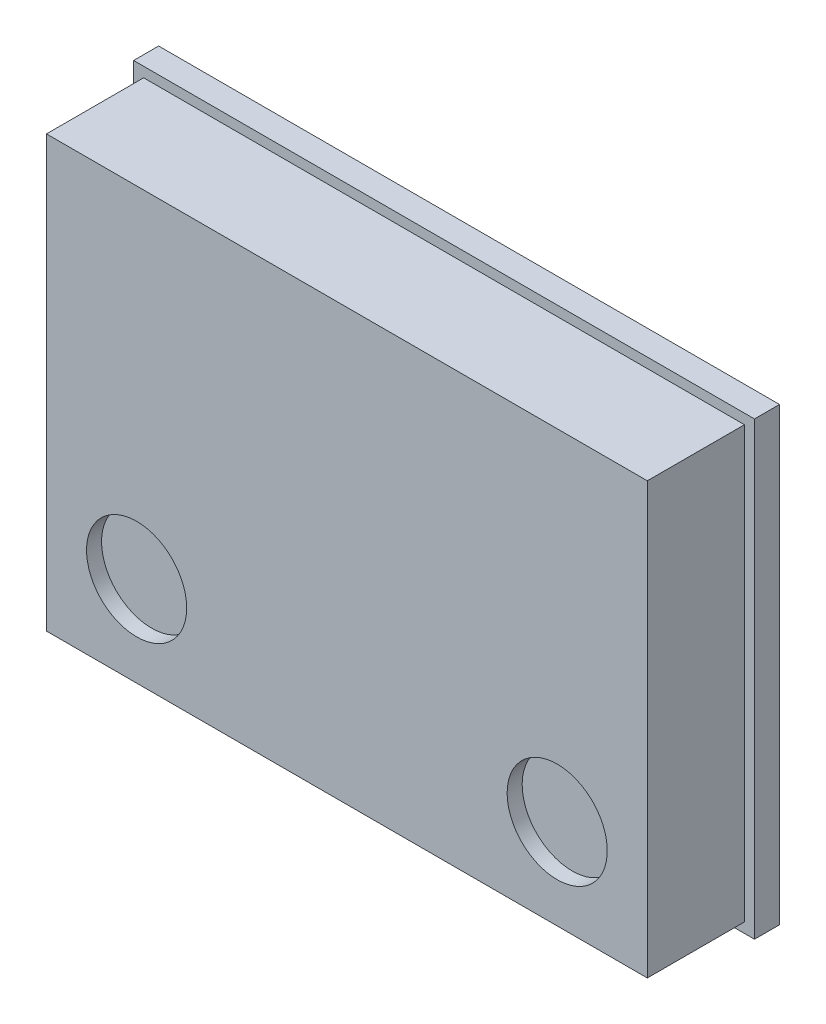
ISO-10303-21;
HEADER;
FILE_DESCRIPTION(('STEP AP214'),'2;1');
FILE_NAME('part.step','',(''),(''),'','','');
FILE_SCHEMA(('AUTOMOTIVE_DESIGN { 1 0 10303 214 1 1 1 1 }'));
ENDSEC;
DATA;
#1=APPLICATION_CONTEXT('core data for automotive mechanical design processes');
#2=APPLICATION_PROTOCOL_DEFINITION('international standard','automotive_design',2000,#1);
#3=PRODUCT_CONTEXT('',#1,'mechanical');
#4=PRODUCT('Part','Part','',(#3));
#5=PRODUCT_RELATED_PRODUCT_CATEGORY('part','',(#4));
#6=PRODUCT_DEFINITION_FORMATION('','',#4);
#7=PRODUCT_DEFINITION_CONTEXT('part definition',#1,'design');
#8=PRODUCT_DEFINITION('design','',#6,#7);
#9=PRODUCT_DEFINITION_SHAPE('','',#8);
#10=(LENGTH_UNIT() NAMED_UNIT(*) SI_UNIT(.MILLI.,.METRE.));
#11=(NAMED_UNIT(*) PLANE_ANGLE_UNIT() SI_UNIT($,.RADIAN.));
#12=(NAMED_UNIT(*) SI_UNIT($,.STERADIAN.) SOLID_ANGLE_UNIT());
#13=UNCERTAINTY_MEASURE_WITH_UNIT(LENGTH_MEASURE(1.E-05),#10,'distance_accuracy_value','');
#14=(GEOMETRIC_REPRESENTATION_CONTEXT(3) GLOBAL_UNCERTAINTY_ASSIGNED_CONTEXT((#13)) GLOBAL_UNIT_ASSIGNED_CONTEXT((#10,
#11,#12)) REPRESENTATION_CONTEXT('',''));
#15=CARTESIAN_POINT('',(0.,0.,0.));
#16=DIRECTION('',(0.,0.,1.));
#17=DIRECTION('',(1.,0.,0.));
#18=AXIS2_PLACEMENT_3D('',#15,#16,#17);
#19=CARTESIAN_POINT('',(-3.,-2.9,1.095));
#20=DIRECTION('',(1.,0.,0.));
#21=DIRECTION('',(0.,0.,-1.));
#22=AXIS2_PLACEMENT_3D('',#19,#20,#21);
#23=PLANE('',#22);
#24=DIRECTION('',(0.,-1.,0.));
#25=VECTOR('',#24,1.);
#26=CARTESIAN_POINT('',(-3.,-2.9,0.125));
#27=LINE('',#26,#25);
#28=CARTESIAN_POINT('',(-3.,1.4,0.125));
#29=VERTEX_POINT('',#28);
#30=CARTESIAN_POINT('',(-3.,-2.9,0.125));
#31=VERTEX_POINT('',#30);
#32=EDGE_CURVE('E86',#29,#31,#27,.T.);
#33=ORIENTED_EDGE('',*,*,#32,.T.);
#34=DIRECTION('',(0.,0.,-1.));
#35=VECTOR('',#34,1.);
#36=CARTESIAN_POINT('',(-3.,-2.9,1.095));
#37=LINE('',#36,#35);
#38=CARTESIAN_POINT('',(-3.,-2.9,1.095));
#39=VERTEX_POINT('',#38);
#40=EDGE_CURVE('E12',#39,#31,#37,.T.);
#41=ORIENTED_EDGE('',*,*,#40,.F.);
#42=DIRECTION('',(0.,-1.,0.));
#43=VECTOR('',#42,1.);
#44=CARTESIAN_POINT('',(-3.,-2.9,1.095));
#45=LINE('',#44,#43);
#46=CARTESIAN_POINT('',(-3.,1.4,1.095));
#47=VERTEX_POINT('',#46);
#48=EDGE_CURVE('E88',#47,#39,#45,.T.);
#49=ORIENTED_EDGE('',*,*,#48,.F.);
#50=DIRECTION('',(0.,0.,-1.));
#51=VECTOR('',#50,1.);
#52=CARTESIAN_POINT('',(-3.,1.4,1.095));
#53=LINE('',#52,#51);
#54=EDGE_CURVE('E49',#47,#29,#53,.T.);
#55=ORIENTED_EDGE('',*,*,#54,.T.);
#56=EDGE_LOOP('',(#33,#41,#49,#55));
#57=FACE_BOUND('',#56,.T.);
#58=ADVANCED_FACE('F41',(#57),#23,.F.);
#59=CARTESIAN_POINT('',(-3.,-2.9,1.095));
#60=DIRECTION('',(0.,1.,0.));
#61=DIRECTION('',(0.,0.,1.));
#62=AXIS2_PLACEMENT_3D('',#59,#60,#61);
#63=PLANE('',#62);
#64=DIRECTION('',(1.,0.,0.));
#65=VECTOR('',#64,1.);
#66=CARTESIAN_POINT('',(-3.,-2.9,0.125));
#67=LINE('',#66,#65);
#68=CARTESIAN_POINT('',(3.,-2.9,0.125));
#69=VERTEX_POINT('',#68);
#70=EDGE_CURVE('E69',#31,#69,#67,.T.);
#71=ORIENTED_EDGE('',*,*,#70,.T.);
#72=DIRECTION('',(0.,0.,-1.));
#73=VECTOR('',#72,1.);
#74=CARTESIAN_POINT('',(3.,-2.9,1.095));
#75=LINE('',#74,#73);
#76=CARTESIAN_POINT('',(3.,-2.9,1.095));
#77=VERTEX_POINT('',#76);
#78=EDGE_CURVE('E95',#77,#69,#75,.T.);
#79=ORIENTED_EDGE('',*,*,#78,.F.);
#80=DIRECTION('',(1.,0.,0.));
#81=VECTOR('',#80,1.);
#82=CARTESIAN_POINT('',(-3.,-2.9,1.095));
#83=LINE('',#82,#81);
#84=EDGE_CURVE('E117',#39,#77,#83,.T.);
#85=ORIENTED_EDGE('',*,*,#84,.F.);
#86=ORIENTED_EDGE('',*,*,#40,.T.);
#87=EDGE_LOOP('',(#71,#79,#85,#86));
#88=FACE_BOUND('',#87,.T.);
#89=ADVANCED_FACE('F127',(#88),#63,.F.);
#90=CARTESIAN_POINT('',(-3.,1.4,1.095));
#91=DIRECTION('',(0.,-1.,0.));
#92=DIRECTION('',(0.,0.,-1.));
#93=AXIS2_PLACEMENT_3D('',#90,#91,#92);
#94=PLANE('',#93);
#95=DIRECTION('',(-1.,0.,0.));
#96=VECTOR('',#95,1.);
#97=CARTESIAN_POINT('',(-3.,1.4,0.125));
#98=LINE('',#97,#96);
#99=CARTESIAN_POINT('',(3.,1.4,0.125));
#100=VERTEX_POINT('',#99);
#101=EDGE_CURVE('E81',#100,#29,#98,.T.);
#102=ORIENTED_EDGE('',*,*,#101,.T.);
#103=ORIENTED_EDGE('',*,*,#54,.F.);
#104=DIRECTION('',(-1.,0.,0.));
#105=VECTOR('',#104,1.);
#106=CARTESIAN_POINT('',(-3.,1.4,1.095));
#107=LINE('',#106,#105);
#108=CARTESIAN_POINT('',(3.,1.4,1.095));
#109=VERTEX_POINT('',#108);
#110=EDGE_CURVE('E57',#109,#47,#107,.T.);
#111=ORIENTED_EDGE('',*,*,#110,.F.);
#112=DIRECTION('',(0.,0.,-1.));
#113=VECTOR('',#112,1.);
#114=CARTESIAN_POINT('',(3.,1.4,1.095));
#115=LINE('',#114,#113);
#116=EDGE_CURVE('E91',#109,#100,#115,.T.);
#117=ORIENTED_EDGE('',*,*,#116,.T.);
#118=EDGE_LOOP('',(#102,#103,#111,#117));
#119=FACE_BOUND('',#118,.T.);
#120=ADVANCED_FACE('F92',(#119),#94,.F.);
#121=CARTESIAN_POINT('',(-3.,1.4,1.095));
#122=DIRECTION('',(0.,0.,-1.));
#123=DIRECTION('',(-1.,0.,0.));
#124=AXIS2_PLACEMENT_3D('',#121,#122,#123);
#125=PLANE('',#124);
#126=CARTESIAN_POINT('',(-2.1,-2.,1.095));
#127=DIRECTION('',(0.,0.,1.));
#128=DIRECTION('',(1.,0.,0.));
#129=AXIS2_PLACEMENT_3D('',#126,#127,#128);
#130=CIRCLE('',#129,0.5);
#131=CARTESIAN_POINT('',(-1.6,-2.,1.095));
#132=VERTEX_POINT('',#131);
#133=EDGE_CURVE('E110',#132,#132,#130,.T.);
#134=ORIENTED_EDGE('',*,*,#133,.F.);
#135=EDGE_LOOP('',(#134));
#136=FACE_BOUND('',#135,.T.);
#137=ORIENTED_EDGE('',*,*,#48,.T.);
#138=ORIENTED_EDGE('',*,*,#84,.T.);
#139=DIRECTION('',(0.,-1.,0.));
#140=VECTOR('',#139,1.);
#141=CARTESIAN_POINT('',(3.,-2.9,1.095));
#142=LINE('',#141,#140);
#143=EDGE_CURVE('E96',#109,#77,#142,.T.);
#144=ORIENTED_EDGE('',*,*,#143,.F.);
#145=ORIENTED_EDGE('',*,*,#110,.T.);
#146=EDGE_LOOP('',(#137,#138,#144,#145));
#147=FACE_BOUND('',#146,.T.);
#148=CARTESIAN_POINT('',(2.1,-2.,1.095));
#149=DIRECTION('',(0.,0.,-1.));
#150=DIRECTION('',(-1.,0.,0.));
#151=AXIS2_PLACEMENT_3D('',#148,#149,#150);
#152=CIRCLE('',#151,0.5);
#153=CARTESIAN_POINT('',(1.6,-2.,1.095));
#154=VERTEX_POINT('',#153);
#155=EDGE_CURVE('E105',#154,#154,#152,.T.);
#156=ORIENTED_EDGE('',*,*,#155,.T.);
#157=EDGE_LOOP('',(#156));
#158=FACE_BOUND('',#157,.T.);
#159=ADVANCED_FACE('F124',(#136,#147,#158),#125,.F.);
#160=CARTESIAN_POINT('',(-3.,1.4,0.125));
#161=DIRECTION('',(0.,0.,-1.));
#162=DIRECTION('',(-1.,0.,0.));
#163=AXIS2_PLACEMENT_3D('',#160,#161,#162);
#164=PLANE('',#163);
#165=ORIENTED_EDGE('',*,*,#32,.F.);
#166=ORIENTED_EDGE('',*,*,#101,.F.);
#167=DIRECTION('',(0.,-1.,0.));
#168=VECTOR('',#167,1.);
#169=CARTESIAN_POINT('',(3.,-2.9,0.125));
#170=LINE('',#169,#168);
#171=EDGE_CURVE('E84',#100,#69,#170,.T.);
#172=ORIENTED_EDGE('',*,*,#171,.T.);
#173=ORIENTED_EDGE('',*,*,#70,.F.);
#174=EDGE_LOOP('',(#165,#166,#172,#173));
#175=FACE_BOUND('',#174,.T.);
#176=ADVANCED_FACE('F82',(#175),#164,.T.);
#177=CARTESIAN_POINT('',(-2.1,-2.,0.945));
#178=DIRECTION('',(0.,0.,1.));
#179=DIRECTION('',(1.,0.,0.));
#180=AXIS2_PLACEMENT_3D('',#177,#178,#179);
#181=CYLINDRICAL_SURFACE('',#180,0.5);
#182=CARTESIAN_POINT('',(-2.1,-2.,0.945));
#183=DIRECTION('',(0.,0.,1.));
#184=DIRECTION('',(1.,0.,0.));
#185=AXIS2_PLACEMENT_3D('',#182,#183,#184);
#186=CIRCLE('',#185,0.5);
#187=CARTESIAN_POINT('',(-1.6,-2.,0.945));
#188=VERTEX_POINT('',#187);
#189=EDGE_CURVE('E111',#188,#188,#186,.T.);
#190=ORIENTED_EDGE('',*,*,#189,.F.);
#191=EDGE_LOOP('',(#190));
#192=FACE_BOUND('',#191,.T.);
#193=ORIENTED_EDGE('',*,*,#133,.T.);
#194=EDGE_LOOP('',(#193));
#195=FACE_BOUND('',#194,.T.);
#196=ADVANCED_FACE('F137',(#192,#195),#181,.F.);
#197=CARTESIAN_POINT('',(-2.1,-2.,0.945));
#198=DIRECTION('',(0.,0.,1.));
#199=DIRECTION('',(1.,0.,0.));
#200=AXIS2_PLACEMENT_3D('',#197,#198,#199);
#201=PLANE('',#200);
#202=ORIENTED_EDGE('',*,*,#189,.T.);
#203=EDGE_LOOP('',(#202));
#204=FACE_BOUND('',#203,.T.);
#205=ADVANCED_FACE('F143',(#204),#201,.T.);
#206=CARTESIAN_POINT('',(3.,-2.9,1.095));
#207=DIRECTION('',(-1.,0.,0.));
#208=DIRECTION('',(0.,0.,-1.));
#209=AXIS2_PLACEMENT_3D('',#206,#207,#208);
#210=PLANE('',#209);
#211=ORIENTED_EDGE('',*,*,#171,.F.);
#212=ORIENTED_EDGE('',*,*,#116,.F.);
#213=ORIENTED_EDGE('',*,*,#143,.T.);
#214=ORIENTED_EDGE('',*,*,#78,.T.);
#215=EDGE_LOOP('',(#211,#212,#213,#214));
#216=FACE_BOUND('',#215,.T.);
#217=ADVANCED_FACE('F99',(#216),#210,.F.);
#218=CARTESIAN_POINT('',(2.1,-2.,0.945));
#219=DIRECTION('',(0.,0.,1.));
#220=DIRECTION('',(-1.,0.,0.));
#221=AXIS2_PLACEMENT_3D('',#218,#219,#220);
#222=CYLINDRICAL_SURFACE('',#221,0.5);
#223=CARTESIAN_POINT('',(2.1,-2.,0.945));
#224=DIRECTION('',(0.,0.,-1.));
#225=DIRECTION('',(-1.,0.,0.));
#226=AXIS2_PLACEMENT_3D('',#223,#224,#225);
#227=CIRCLE('',#226,0.5);
#228=CARTESIAN_POINT('',(1.6,-2.,0.945));
#229=VERTEX_POINT('',#228);
#230=EDGE_CURVE('E101',#229,#229,#227,.T.);
#231=ORIENTED_EDGE('',*,*,#230,.T.);
#232=EDGE_LOOP('',(#231));
#233=FACE_BOUND('',#232,.T.);
#234=ORIENTED_EDGE('',*,*,#155,.F.);
#235=EDGE_LOOP('',(#234));
#236=FACE_BOUND('',#235,.T.);
#237=ADVANCED_FACE('F150',(#233,#236),#222,.F.);
#238=CARTESIAN_POINT('',(2.1,-2.,0.945));
#239=DIRECTION('',(0.,0.,1.));
#240=DIRECTION('',(-1.,0.,0.));
#241=AXIS2_PLACEMENT_3D('',#238,#239,#240);
#242=PLANE('',#241);
#243=ORIENTED_EDGE('',*,*,#230,.F.);
#244=EDGE_LOOP('',(#243));
#245=FACE_BOUND('',#244,.T.);
#246=ADVANCED_FACE('F153',(#245),#242,.T.);
#247=CLOSED_SHELL('',(#58,#89,#120,#159,#176,#196,#205,#217,#237,#246));
#248=MANIFOLD_SOLID_BREP('B2',#247);
#249=CARTESIAN_POINT('',(-3.1,-3.,-0.125));
#250=DIRECTION('',(-1.,0.,0.));
#251=DIRECTION('',(0.,0.,1.));
#252=AXIS2_PLACEMENT_3D('',#249,#250,#251);
#253=PLANE('',#252);
#254=DIRECTION('',(0.,0.,1.));
#255=VECTOR('',#254,1.);
#256=CARTESIAN_POINT('',(-3.1,-3.,-0.125));
#257=LINE('',#256,#255);
#258=CARTESIAN_POINT('',(-3.1,-3.,-0.125));
#259=VERTEX_POINT('',#258);
#260=CARTESIAN_POINT('',(-3.1,-3.,0.125));
#261=VERTEX_POINT('',#260);
#262=EDGE_CURVE('E240',#259,#261,#257,.T.);
#263=ORIENTED_EDGE('',*,*,#262,.T.);
#264=DIRECTION('',(0.,-1.,0.));
#265=VECTOR('',#264,1.);
#266=CARTESIAN_POINT('',(-3.1,-3.,0.125));
#267=LINE('',#266,#265);
#268=CARTESIAN_POINT('',(-3.1,1.5,0.125));
#269=VERTEX_POINT('',#268);
#270=EDGE_CURVE('E281',#269,#261,#267,.T.);
#271=ORIENTED_EDGE('',*,*,#270,.F.);
#272=DIRECTION('',(0.,0.,1.));
#273=VECTOR('',#272,1.);
#274=CARTESIAN_POINT('',(-3.1,1.5,-0.125));
#275=LINE('',#274,#273);
#276=CARTESIAN_POINT('',(-3.1,1.5,-0.125));
#277=VERTEX_POINT('',#276);
#278=EDGE_CURVE('E39',#277,#269,#275,.T.);
#279=ORIENTED_EDGE('',*,*,#278,.F.);
#280=DIRECTION('',(0.,-1.,0.));
#281=VECTOR('',#280,1.);
#282=CARTESIAN_POINT('',(-3.1,-3.,-0.125));
#283=LINE('',#282,#281);
#284=EDGE_CURVE('E303',#277,#259,#283,.T.);
#285=ORIENTED_EDGE('',*,*,#284,.T.);
#286=EDGE_LOOP('',(#263,#271,#279,#285));
#287=FACE_BOUND('',#286,.T.);
#288=ADVANCED_FACE('F237',(#287),#253,.T.);
#289=CARTESIAN_POINT('',(-3.1,1.5,-0.125));
#290=DIRECTION('',(0.,1.,0.));
#291=DIRECTION('',(-1.,0.,0.));
#292=AXIS2_PLACEMENT_3D('',#289,#290,#291);
#293=PLANE('',#292);
#294=ORIENTED_EDGE('',*,*,#278,.T.);
#295=DIRECTION('',(-1.,0.,0.));
#296=VECTOR('',#295,1.);
#297=CARTESIAN_POINT('',(-3.1,1.5,0.125));
#298=LINE('',#297,#296);
#299=CARTESIAN_POINT('',(3.1,1.5,0.125));
#300=VERTEX_POINT('',#299);
#301=EDGE_CURVE('E283',#300,#269,#298,.T.);
#302=ORIENTED_EDGE('',*,*,#301,.F.);
#303=DIRECTION('',(0.,0.,1.));
#304=VECTOR('',#303,1.);
#305=CARTESIAN_POINT('',(3.1,1.5,-0.125));
#306=LINE('',#305,#304);
#307=CARTESIAN_POINT('',(3.1,1.5,-0.125));
#308=VERTEX_POINT('',#307);
#309=EDGE_CURVE('E291',#308,#300,#306,.T.);
#310=ORIENTED_EDGE('',*,*,#309,.F.);
#311=DIRECTION('',(-1.,0.,0.));
#312=VECTOR('',#311,1.);
#313=CARTESIAN_POINT('',(-3.1,1.5,-0.125));
#314=LINE('',#313,#312);
#315=EDGE_CURVE('E306',#308,#277,#314,.T.);
#316=ORIENTED_EDGE('',*,*,#315,.T.);
#317=EDGE_LOOP('',(#294,#302,#310,#316));
#318=FACE_BOUND('',#317,.T.);
#319=ADVANCED_FACE('F311',(#318),#293,.T.);
#320=CARTESIAN_POINT('',(-3.1,-3.,-0.125));
#321=DIRECTION('',(0.,-1.,0.));
#322=DIRECTION('',(0.,0.,-1.));
#323=AXIS2_PLACEMENT_3D('',#320,#321,#322);
#324=PLANE('',#323);
#325=DIRECTION('',(1.,0.,0.));
#326=VECTOR('',#325,1.);
#327=CARTESIAN_POINT('',(-3.1,-3.,-0.125));
#328=LINE('',#327,#326);
#329=CARTESIAN_POINT('',(3.1,-3.,-0.125));
#330=VERTEX_POINT('',#329);
#331=EDGE_CURVE('E295',#259,#330,#328,.T.);
#332=ORIENTED_EDGE('',*,*,#331,.T.);
#333=DIRECTION('',(0.,0.,1.));
#334=VECTOR('',#333,1.);
#335=CARTESIAN_POINT('',(3.1,-3.,-0.125));
#336=LINE('',#335,#334);
#337=CARTESIAN_POINT('',(3.1,-3.,0.125));
#338=VERTEX_POINT('',#337);
#339=EDGE_CURVE('E289',#330,#338,#336,.T.);
#340=ORIENTED_EDGE('',*,*,#339,.T.);
#341=DIRECTION('',(1.,0.,0.));
#342=VECTOR('',#341,1.);
#343=CARTESIAN_POINT('',(-3.1,-3.,0.125));
#344=LINE('',#343,#342);
#345=EDGE_CURVE('E275',#261,#338,#344,.T.);
#346=ORIENTED_EDGE('',*,*,#345,.F.);
#347=ORIENTED_EDGE('',*,*,#262,.F.);
#348=EDGE_LOOP('',(#332,#340,#346,#347));
#349=FACE_BOUND('',#348,.T.);
#350=ADVANCED_FACE('F294',(#349),#324,.T.);
#351=CARTESIAN_POINT('',(-3.1,1.5,-0.125));
#352=DIRECTION('',(0.,0.,-1.));
#353=DIRECTION('',(-1.,0.,0.));
#354=AXIS2_PLACEMENT_3D('',#351,#352,#353);
#355=PLANE('',#354);
#356=ORIENTED_EDGE('',*,*,#284,.F.);
#357=ORIENTED_EDGE('',*,*,#315,.F.);
#358=DIRECTION('',(0.,-1.,0.));
#359=VECTOR('',#358,1.);
#360=CARTESIAN_POINT('',(3.1,-3.,-0.125));
#361=LINE('',#360,#359);
#362=EDGE_CURVE('E292',#308,#330,#361,.T.);
#363=ORIENTED_EDGE('',*,*,#362,.T.);
#364=ORIENTED_EDGE('',*,*,#331,.F.);
#365=EDGE_LOOP('',(#356,#357,#363,#364));
#366=FACE_BOUND('',#365,.T.);
#367=ADVANCED_FACE('F310',(#366),#355,.T.);
#368=CARTESIAN_POINT('',(-3.1,1.5,0.125));
#369=DIRECTION('',(0.,0.,-1.));
#370=DIRECTION('',(-1.,0.,0.));
#371=AXIS2_PLACEMENT_3D('',#368,#369,#370);
#372=PLANE('',#371);
#373=ORIENTED_EDGE('',*,*,#270,.T.);
#374=ORIENTED_EDGE('',*,*,#345,.T.);
#375=DIRECTION('',(0.,-1.,0.));
#376=VECTOR('',#375,1.);
#377=CARTESIAN_POINT('',(3.1,-3.,0.125));
#378=LINE('',#377,#376);
#379=EDGE_CURVE('E279',#300,#338,#378,.T.);
#380=ORIENTED_EDGE('',*,*,#379,.F.);
#381=ORIENTED_EDGE('',*,*,#301,.T.);
#382=EDGE_LOOP('',(#373,#374,#380,#381));
#383=FACE_BOUND('',#382,.T.);
#384=ADVANCED_FACE('F277',(#383),#372,.F.);
#385=CARTESIAN_POINT('',(3.1,-3.,-0.125));
#386=DIRECTION('',(1.,0.,0.));
#387=DIRECTION('',(0.,0.,1.));
#388=AXIS2_PLACEMENT_3D('',#385,#386,#387);
#389=PLANE('',#388);
#390=ORIENTED_EDGE('',*,*,#339,.F.);
#391=ORIENTED_EDGE('',*,*,#362,.F.);
#392=ORIENTED_EDGE('',*,*,#309,.T.);
#393=ORIENTED_EDGE('',*,*,#379,.T.);
#394=EDGE_LOOP('',(#390,#391,#392,#393));
#395=FACE_BOUND('',#394,.T.);
#396=ADVANCED_FACE('F287',(#395),#389,.T.);
#397=CLOSED_SHELL('',(#288,#319,#350,#367,#384,#396));
#398=MANIFOLD_SOLID_BREP('B6',#397);
#399=ADVANCED_BREP_SHAPE_REPRESENTATION('',(#18,#248,#398),#14);
#400=SHAPE_DEFINITION_REPRESENTATION(#9,#399);
ENDSEC;
END-ISO-10303-21;
